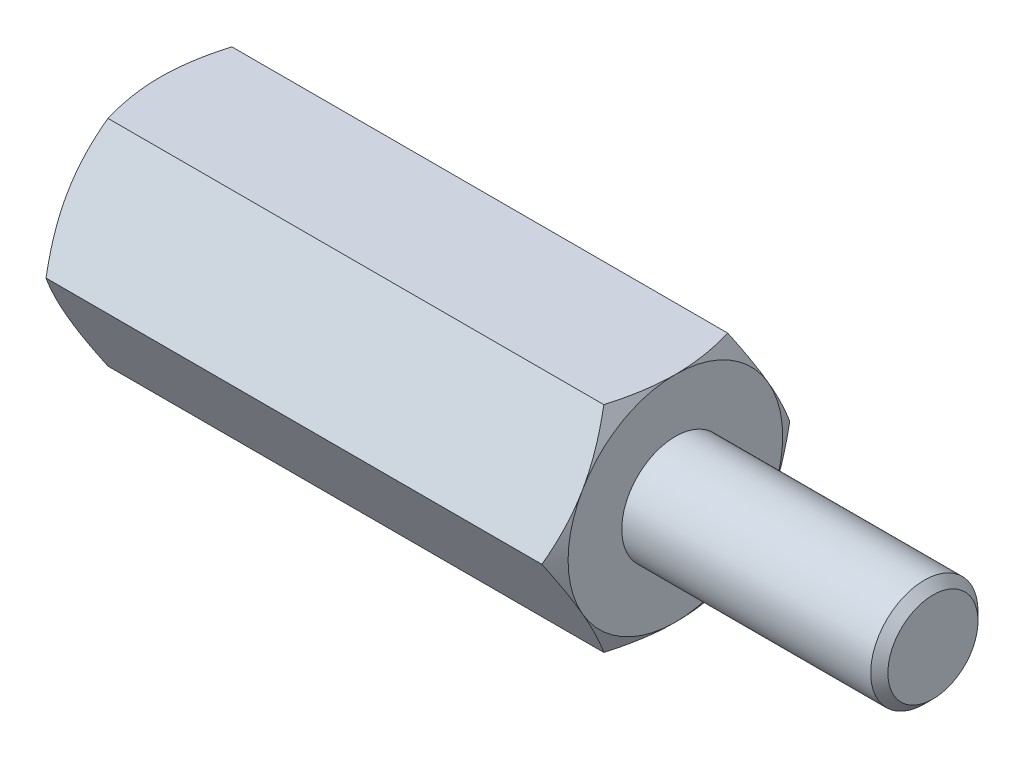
ISO-10303-21;
HEADER;
FILE_DESCRIPTION(('STEP AP214'),'2;1');
FILE_NAME('part.step','',(''),(''),'','','');
FILE_SCHEMA(('AUTOMOTIVE_DESIGN { 1 0 10303 214 1 1 1 1 }'));
ENDSEC;
DATA;
#1=APPLICATION_CONTEXT('core data for automotive mechanical design processes');
#2=APPLICATION_PROTOCOL_DEFINITION('international standard','automotive_design',2000,#1);
#3=PRODUCT_CONTEXT('',#1,'mechanical');
#4=PRODUCT('Part','Part','',(#3));
#5=PRODUCT_RELATED_PRODUCT_CATEGORY('part','',(#4));
#6=PRODUCT_DEFINITION_FORMATION('','',#4);
#7=PRODUCT_DEFINITION_CONTEXT('part definition',#1,'design');
#8=PRODUCT_DEFINITION('design','',#6,#7);
#9=PRODUCT_DEFINITION_SHAPE('','',#8);
#10=(LENGTH_UNIT() NAMED_UNIT(*) SI_UNIT(.MILLI.,.METRE.));
#11=(NAMED_UNIT(*) PLANE_ANGLE_UNIT() SI_UNIT($,.RADIAN.));
#12=(NAMED_UNIT(*) SI_UNIT($,.STERADIAN.) SOLID_ANGLE_UNIT());
#13=UNCERTAINTY_MEASURE_WITH_UNIT(LENGTH_MEASURE(1.E-05),#10,'distance_accuracy_value','');
#14=(GEOMETRIC_REPRESENTATION_CONTEXT(3) GLOBAL_UNCERTAINTY_ASSIGNED_CONTEXT((#13)) GLOBAL_UNIT_ASSIGNED_CONTEXT((#10,
#11,#12)) REPRESENTATION_CONTEXT('',''));
#15=CARTESIAN_POINT('',(0.,0.,0.));
#16=DIRECTION('',(0.,0.,1.));
#17=DIRECTION('',(1.,0.,0.));
#18=AXIS2_PLACEMENT_3D('',#15,#16,#17);
#19=CARTESIAN_POINT('',(6.,2.5,-1.44337567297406));
#20=DIRECTION('',(1.,0.,0.));
#21=DIRECTION('',(0.,0.,-1.));
#22=AXIS2_PLACEMENT_3D('',#19,#20,#21);
#23=PLANE('',#22);
#24=CARTESIAN_POINT('',(6.,0.,0.));
#25=DIRECTION('',(1.,0.,0.));
#26=DIRECTION('',(0.,0.,-1.));
#27=AXIS2_PLACEMENT_3D('',#24,#25,#26);
#28=CIRCLE('',#27,2.5);
#29=CARTESIAN_POINT('',(6.,-1.25,-2.1650635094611));
#30=VERTEX_POINT('',#29);
#31=CARTESIAN_POINT('',(6.,1.25,-2.1650635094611));
#32=VERTEX_POINT('',#31);
#33=EDGE_CURVE('E288',#30,#32,#28,.T.);
#34=ORIENTED_EDGE('',*,*,#33,.T.);
#35=CARTESIAN_POINT('',(6.,2.5,0.));
#36=VERTEX_POINT('',#35);
#37=EDGE_CURVE('E53',#32,#36,#28,.T.);
#38=ORIENTED_EDGE('',*,*,#37,.T.);
#39=CARTESIAN_POINT('',(6.,1.25,2.1650635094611));
#40=VERTEX_POINT('',#39);
#41=EDGE_CURVE('E297',#36,#40,#28,.T.);
#42=ORIENTED_EDGE('',*,*,#41,.T.);
#43=CARTESIAN_POINT('',(6.,-1.25,2.1650635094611));
#44=VERTEX_POINT('',#43);
#45=EDGE_CURVE('E301',#40,#44,#28,.T.);
#46=ORIENTED_EDGE('',*,*,#45,.T.);
#47=CARTESIAN_POINT('',(6.,0.,0.));
#48=DIRECTION('',(-1.,0.,0.));
#49=DIRECTION('',(0.,-1.,0.));
#50=AXIS2_PLACEMENT_3D('',#47,#48,#49);
#51=CIRCLE('',#50,2.5);
#52=CARTESIAN_POINT('',(6.,-2.5,0.));
#53=VERTEX_POINT('',#52);
#54=EDGE_CURVE('E193',#53,#44,#51,.T.);
#55=ORIENTED_EDGE('',*,*,#54,.F.);
#56=EDGE_CURVE('E61',#53,#30,#28,.T.);
#57=ORIENTED_EDGE('',*,*,#56,.T.);
#58=EDGE_LOOP('',(#34,#38,#42,#46,#55,#57));
#59=FACE_BOUND('',#58,.T.);
#60=CARTESIAN_POINT('',(6.,0.,0.));
#61=DIRECTION('',(1.,0.,0.));
#62=DIRECTION('',(0.,0.,-1.));
#63=AXIS2_PLACEMENT_3D('',#60,#61,#62);
#64=CIRCLE('',#63,1.25);
#65=CARTESIAN_POINT('',(6.,0.,-1.25));
#66=VERTEX_POINT('',#65);
#67=EDGE_CURVE('E322',#66,#66,#64,.T.);
#68=ORIENTED_EDGE('',*,*,#67,.F.);
#69=EDGE_LOOP('',(#68));
#70=FACE_BOUND('',#69,.T.);
#71=ADVANCED_FACE('F37',(#59,#70),#23,.T.);
#72=CARTESIAN_POINT('',(6.,0.,-2.88675134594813));
#73=DIRECTION('',(0.,-0.5,0.866025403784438));
#74=DIRECTION('',(0.,-0.866025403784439,-0.5));
#75=AXIS2_PLACEMENT_3D('',#72,#73,#74);
#76=PLANE('',#75);
#77=CARTESIAN_POINT('',(5.77664233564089,-0.000199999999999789,-2.88686681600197));
#78=CARTESIAN_POINT('',(5.81327837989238,0.109663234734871,-2.82343724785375));
#79=CARTESIAN_POINT('',(5.84659778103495,0.220474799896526,-2.75946016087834));
#80=CARTESIAN_POINT('',(5.90475771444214,0.444016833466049,-2.63039810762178));
#81=CARTESIAN_POINT('',(5.92957767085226,0.556751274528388,-2.5653108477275));
#82=CARTESIAN_POINT('',(5.96821434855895,0.780822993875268,-2.43594298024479));
#83=CARTESIAN_POINT('',(5.98228820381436,0.892125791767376,-2.37168227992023));
#84=CARTESIAN_POINT('',(5.99909084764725,1.11525522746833,-2.24285844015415));
#85=CARTESIAN_POINT('',(6.00183354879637,1.22708105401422,-2.17829576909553));
#86=CARTESIAN_POINT('',(5.99613423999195,1.43604197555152,-2.05765212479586));
#87=CARTESIAN_POINT('',(5.98909160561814,1.53320831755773,-2.0015531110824));
#88=CARTESIAN_POINT('',(5.96676858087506,1.726907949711,-1.88972057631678));
#89=CARTESIAN_POINT('',(5.95148056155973,1.82344056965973,-1.8339874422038));
#90=CARTESIAN_POINT('',(5.91326090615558,2.01753972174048,-1.7219242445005));
#91=CARTESIAN_POINT('',(5.89016722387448,2.11508168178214,-1.66560836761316));
#92=CARTESIAN_POINT('',(5.83775334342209,2.30871060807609,-1.55381665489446));
#93=CARTESIAN_POINT('',(5.80844546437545,2.40480005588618,-1.49833938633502));
#94=CARTESIAN_POINT('',(5.77664233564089,2.5002,-1.44326020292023));
#95=B_SPLINE_CURVE_WITH_KNOTS('',3,(#77,#78,#79,#80,#81,#82,#83,#84,#85,#86,#87,#88,#89,#90,#91,
#92,#93,#94),.UNSPECIFIED.,.F.,.F.,(4,2,2,2,2,2,2,2,4),(0.,0.396285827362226,0.793524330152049,
1.18093086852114,1.56786160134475,1.90479741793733,2.24204551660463,2.58677531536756,
2.93082800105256),.UNSPECIFIED.);
#96=CARTESIAN_POINT('',(5.7767090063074,0.,-2.88675134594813));
#97=VERTEX_POINT('',#96);
#98=EDGE_CURVE('E330',#97,#32,#95,.T.);
#99=ORIENTED_EDGE('',*,*,#98,.F.);
#100=DIRECTION('',(-1.,0.,0.));
#101=VECTOR('',#100,1.);
#102=CARTESIAN_POINT('',(6.,0.,-2.88675134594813));
#103=LINE('',#102,#101);
#104=CARTESIAN_POINT('',(-5.7767090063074,0.,-2.88675134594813));
#105=VERTEX_POINT('',#104);
#106=EDGE_CURVE('E264',#97,#105,#103,.T.);
#107=ORIENTED_EDGE('',*,*,#106,.T.);
#108=CARTESIAN_POINT('',(-5.77664233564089,2.5002,-1.44326020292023));
#109=CARTESIAN_POINT('',(-5.81327837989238,2.39033676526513,-1.50668977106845));
#110=CARTESIAN_POINT('',(-5.84659778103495,2.27952520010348,-1.57066685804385));
#111=CARTESIAN_POINT('',(-5.90475771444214,2.05598316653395,-1.69972891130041));
#112=CARTESIAN_POINT('',(-5.92957767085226,1.94324872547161,-1.7648161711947));
#113=CARTESIAN_POINT('',(-5.96821434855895,1.71917700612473,-1.8941840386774));
#114=CARTESIAN_POINT('',(-5.98228820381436,1.60787420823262,-1.95844473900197));
#115=CARTESIAN_POINT('',(-5.99909084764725,1.38474477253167,-2.08726857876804));
#116=CARTESIAN_POINT('',(-6.00183354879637,1.27291894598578,-2.15183124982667));
#117=CARTESIAN_POINT('',(-5.99613423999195,1.06395802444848,-2.27247489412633));
#118=CARTESIAN_POINT('',(-5.98909160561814,0.96679168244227,-2.32857390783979));
#119=CARTESIAN_POINT('',(-5.96676858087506,0.773092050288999,-2.44040644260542));
#120=CARTESIAN_POINT('',(-5.95148056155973,0.676559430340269,-2.49613957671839));
#121=CARTESIAN_POINT('',(-5.91326090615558,0.482460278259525,-2.60820277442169));
#122=CARTESIAN_POINT('',(-5.89016722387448,0.38491831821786,-2.66451865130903));
#123=CARTESIAN_POINT('',(-5.83775334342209,0.191289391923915,-2.77631036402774));
#124=CARTESIAN_POINT('',(-5.80844546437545,0.095199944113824,-2.83178763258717));
#125=CARTESIAN_POINT('',(-5.77664233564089,-0.000199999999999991,-2.88686681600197));
#126=B_SPLINE_CURVE_WITH_KNOTS('',3,(#108,#109,#110,#111,#112,#113,#114,#115,#116,#117,#118,
#119,#120,#121,#122,#123,#124,#125),.UNSPECIFIED.,.F.,.F.,(4,2,2,2,2,2,2,2,4),(0.,
0.396285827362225,0.793524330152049,1.18093086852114,1.56786160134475,1.90479741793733,
2.24204551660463,2.58677531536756,2.93082800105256),.UNSPECIFIED.);
#127=CARTESIAN_POINT('',(-6.,1.25,-2.1650635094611));
#128=VERTEX_POINT('',#127);
#129=EDGE_CURVE('E417',#128,#105,#126,.T.);
#130=ORIENTED_EDGE('',*,*,#129,.F.);
#131=CARTESIAN_POINT('',(-5.7767090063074,2.5,-1.44337567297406));
#132=VERTEX_POINT('',#131);
#133=EDGE_CURVE('E371',#132,#128,#126,.T.);
#134=ORIENTED_EDGE('',*,*,#133,.F.);
#135=DIRECTION('',(-1.,0.,0.));
#136=VECTOR('',#135,1.);
#137=CARTESIAN_POINT('',(6.,2.5,-1.44337567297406));
#138=LINE('',#137,#136);
#139=CARTESIAN_POINT('',(5.77670900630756,2.5,-1.44337567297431));
#140=VERTEX_POINT('',#139);
#141=EDGE_CURVE('E279',#140,#132,#138,.T.);
#142=ORIENTED_EDGE('',*,*,#141,.F.);
#143=EDGE_CURVE('E229',#32,#140,#95,.T.);
#144=ORIENTED_EDGE('',*,*,#143,.F.);
#145=EDGE_LOOP('',(#99,#107,#130,#134,#142,#144));
#146=FACE_BOUND('',#145,.T.);
#147=ADVANCED_FACE('F148',(#146),#76,.F.);
#148=CARTESIAN_POINT('',(6.,2.5,-1.44337567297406));
#149=DIRECTION('',(0.,-1.,0.));
#150=DIRECTION('',(0.,0.,-1.));
#151=AXIS2_PLACEMENT_3D('',#148,#149,#150);
#152=PLANE('',#151);
#153=CARTESIAN_POINT('',(4.76803388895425,2.5,-3.90158441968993));
#154=CARTESIAN_POINT('',(4.82120772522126,2.5,-3.79217004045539));
#155=CARTESIAN_POINT('',(4.87387869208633,2.5,-3.68250707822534));
#156=CARTESIAN_POINT('',(4.97793249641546,2.5,-3.46255185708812));
#157=CARTESIAN_POINT('',(5.02931513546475,2.5,-3.35225950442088));
#158=CARTESIAN_POINT('',(5.13076309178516,2.5,-3.130356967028));
#159=CARTESIAN_POINT('',(5.18081992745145,2.5,-3.01874289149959));
#160=CARTESIAN_POINT('',(5.27891712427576,2.5,-2.79463535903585));
#161=CARTESIAN_POINT('',(5.32695757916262,2.5,-2.68214194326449));
#162=CARTESIAN_POINT('',(5.42201845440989,2.5,-2.45240385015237));
#163=CARTESIAN_POINT('',(5.46895431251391,2.5,-2.33512399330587));
#164=CARTESIAN_POINT('',(5.55933269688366,2.5,-2.09920133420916));
#165=CARTESIAN_POINT('',(5.60277483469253,2.5,-1.98055838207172));
#166=CARTESIAN_POINT('',(5.68504351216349,2.5,-1.74193489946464));
#167=CARTESIAN_POINT('',(5.72387917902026,2.5,-1.6219575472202));
#168=CARTESIAN_POINT('',(5.79570507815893,2.5,-1.38028205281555));
#169=CARTESIAN_POINT('',(5.82869712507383,2.5,-1.25858445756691));
#170=CARTESIAN_POINT('',(5.88709594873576,2.5,-1.01406369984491));
#171=CARTESIAN_POINT('',(5.91254379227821,2.5,-0.891250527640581));
#172=CARTESIAN_POINT('',(5.95442751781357,2.5,-0.644071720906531));
#173=CARTESIAN_POINT('',(5.97086432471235,2.5,-0.519706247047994));
#174=CARTESIAN_POINT('',(5.9932006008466,2.5,-0.271679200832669));
#175=CARTESIAN_POINT('',(5.99923751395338,2.5,-0.148030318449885));
#176=CARTESIAN_POINT('',(6.00062561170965,2.5,0.0993395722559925));
#177=CARTESIAN_POINT('',(5.99597656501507,2.5,0.223060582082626));
#178=CARTESIAN_POINT('',(5.97940443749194,2.5,0.432351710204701));
#179=CARTESIAN_POINT('',(5.97010665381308,2.5,0.518143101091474));
#180=CARTESIAN_POINT('',(5.94693847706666,2.5,0.689112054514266));
#181=CARTESIAN_POINT('',(5.93306748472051,2.5,0.774289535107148));
#182=CARTESIAN_POINT('',(5.88532020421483,2.5,1.02876599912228));
#183=CARTESIAN_POINT('',(5.84531764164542,2.5,1.19691958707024));
#184=CARTESIAN_POINT('',(5.75226567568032,2.5,1.53362893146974));
#185=CARTESIAN_POINT('',(5.69893620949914,2.5,1.70210423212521));
#186=CARTESIAN_POINT('',(5.61237169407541,2.5,1.95247339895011));
#187=CARTESIAN_POINT('',(5.58242477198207,2.5,2.03553184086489));
#188=CARTESIAN_POINT('',(5.52068409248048,2.5,2.20095860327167));
#189=CARTESIAN_POINT('',(5.48889037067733,2.5,2.2833269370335));
#190=CARTESIAN_POINT('',(5.40401426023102,2.5,2.49723312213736));
#191=CARTESIAN_POINT('',(5.34971733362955,2.5,2.6282879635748));
#192=CARTESIAN_POINT('',(5.2381273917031,2.5,2.88912034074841));
#193=CARTESIAN_POINT('',(5.1808341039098,2.5,3.01889775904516));
#194=CARTESIAN_POINT('',(5.06393487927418,2.5,3.27745045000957));
#195=CARTESIAN_POINT('',(5.00432825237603,2.5,3.40622540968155));
#196=CARTESIAN_POINT('',(4.8833234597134,2.5,3.66293235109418));
#197=CARTESIAN_POINT('',(4.82192524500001,2.5,3.79086430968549));
#198=CARTESIAN_POINT('',(4.6354580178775,2.5,4.17399495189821));
#199=CARTESIAN_POINT('',(4.50828249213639,2.5,4.42816724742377));
#200=CARTESIAN_POINT('',(4.25034557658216,2.5,4.93461464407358));
#201=CARTESIAN_POINT('',(4.11958483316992,2.5,5.18689007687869));
#202=CARTESIAN_POINT('',(3.86871001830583,2.5,5.66512451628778));
#203=CARTESIAN_POINT('',(3.74882986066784,2.5,5.89120644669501));
#204=CARTESIAN_POINT('',(3.50759021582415,2.5,6.34259369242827));
#205=CARTESIAN_POINT('',(3.38623065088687,2.5,6.56789896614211));
#206=CARTESIAN_POINT('',(3.14278038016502,2.5,7.01722044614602));
#207=CARTESIAN_POINT('',(3.02069305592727,2.5,7.24123848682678));
#208=CARTESIAN_POINT('',(2.77566624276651,2.5,7.68878772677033));
#209=CARTESIAN_POINT('',(2.65272681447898,2.5,7.9123189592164));
#210=CARTESIAN_POINT('',(2.52947566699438,2.5,8.13567697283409));
#211=B_SPLINE_CURVE_WITH_KNOTS('',3,(#153,#154,#155,#156,#157,#158,#159,#160,#161,#162,#163,
#164,#165,#166,#167,#168,#169,#170,#171,#172,#173,#174,#175,#176,#177,#178,#179,#180,#181,#182,
#183,#184,#185,#186,#187,#188,#189,#190,#191,#192,#193,#194,#195,#196,#197,#198,#199,#200,#201,
#202,#203,#204,#205,#206,#207,#208,#209,#210),.UNSPECIFIED.,.F.,.F.,(4,2,2,2,2,2,2,2,2,2,2,2,2,
2,2,2,2,2,2,2,2,2,2,2,2,2,2,2,4),(0.,0.364957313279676,0.729970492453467,1.09692930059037,
1.46387103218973,1.84279746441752,2.22176597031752,2.59997058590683,2.97805755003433,
3.35404692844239,3.72999770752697,4.10094071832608,4.47189175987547,4.73064905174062,
4.98944026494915,5.5072907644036,6.03710483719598,6.30196454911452,6.56681915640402,
6.99233818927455,7.41789598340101,7.84358170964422,8.26927907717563,9.12186602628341,
9.97430025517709,10.7419897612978,11.5097197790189,12.2750964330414,13.0404191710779),.UNSPECIFIED.);
#212=EDGE_CURVE('E227',#140,#36,#211,.T.);
#213=ORIENTED_EDGE('',*,*,#212,.F.);
#214=ORIENTED_EDGE('',*,*,#141,.T.);
#215=CARTESIAN_POINT('',(-4.76803388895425,2.5,-3.90158441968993));
#216=CARTESIAN_POINT('',(-4.82120772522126,2.5,-3.79217004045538));
#217=CARTESIAN_POINT('',(-4.87387869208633,2.5,-3.68250707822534));
#218=CARTESIAN_POINT('',(-4.97793249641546,2.5,-3.46255185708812));
#219=CARTESIAN_POINT('',(-5.02931513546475,2.5,-3.35225950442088));
#220=CARTESIAN_POINT('',(-5.13076309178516,2.5,-3.130356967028));
#221=CARTESIAN_POINT('',(-5.18081992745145,2.5,-3.01874289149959));
#222=CARTESIAN_POINT('',(-5.27891712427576,2.5,-2.79463535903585));
#223=CARTESIAN_POINT('',(-5.32695757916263,2.5,-2.68214194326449));
#224=CARTESIAN_POINT('',(-5.42201845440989,2.5,-2.45240385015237));
#225=CARTESIAN_POINT('',(-5.46895431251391,2.5,-2.33512399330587));
#226=CARTESIAN_POINT('',(-5.55933269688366,2.5,-2.09920133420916));
#227=CARTESIAN_POINT('',(-5.60277483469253,2.5,-1.98055838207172));
#228=CARTESIAN_POINT('',(-5.68504351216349,2.5,-1.74193489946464));
#229=CARTESIAN_POINT('',(-5.72387917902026,2.5,-1.6219575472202));
#230=CARTESIAN_POINT('',(-5.79570507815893,2.5,-1.38028205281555));
#231=CARTESIAN_POINT('',(-5.82869712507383,2.5,-1.25858445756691));
#232=CARTESIAN_POINT('',(-5.88709594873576,2.5,-1.01406369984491));
#233=CARTESIAN_POINT('',(-5.91254379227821,2.5,-0.891250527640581));
#234=CARTESIAN_POINT('',(-5.95442751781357,2.5,-0.64407172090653));
#235=CARTESIAN_POINT('',(-5.97086432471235,2.5,-0.519706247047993));
#236=CARTESIAN_POINT('',(-5.9932006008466,2.5,-0.271679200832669));
#237=CARTESIAN_POINT('',(-5.99923751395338,2.5,-0.148030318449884));
#238=CARTESIAN_POINT('',(-6.00062561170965,2.5,0.0993395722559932));
#239=CARTESIAN_POINT('',(-5.99597656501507,2.5,0.223060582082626));
#240=CARTESIAN_POINT('',(-5.97940443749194,2.5,0.432351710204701));
#241=CARTESIAN_POINT('',(-5.97010665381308,2.5,0.518143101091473));
#242=CARTESIAN_POINT('',(-5.94693847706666,2.5,0.689112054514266));
#243=CARTESIAN_POINT('',(-5.93306748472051,2.5,0.774289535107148));
#244=CARTESIAN_POINT('',(-5.88532020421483,2.5,1.02876599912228));
#245=CARTESIAN_POINT('',(-5.84531764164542,2.5,1.19691958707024));
#246=CARTESIAN_POINT('',(-5.75226567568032,2.5,1.53362893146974));
#247=CARTESIAN_POINT('',(-5.69893620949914,2.5,1.70210423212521));
#248=CARTESIAN_POINT('',(-5.61237169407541,2.5,1.95247339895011));
#249=CARTESIAN_POINT('',(-5.58242477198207,2.5,2.03553184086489));
#250=CARTESIAN_POINT('',(-5.52068409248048,2.5,2.20095860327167));
#251=CARTESIAN_POINT('',(-5.48889037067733,2.5,2.2833269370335));
#252=CARTESIAN_POINT('',(-5.40401426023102,2.5,2.49723312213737));
#253=CARTESIAN_POINT('',(-5.34971733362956,2.5,2.6282879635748));
#254=CARTESIAN_POINT('',(-5.2381273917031,2.5,2.88912034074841));
#255=CARTESIAN_POINT('',(-5.1808341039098,2.5,3.01889775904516));
#256=CARTESIAN_POINT('',(-5.06393487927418,2.5,3.27745045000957));
#257=CARTESIAN_POINT('',(-5.00432825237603,2.5,3.40622540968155));
#258=CARTESIAN_POINT('',(-4.88332345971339,2.5,3.66293235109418));
#259=CARTESIAN_POINT('',(-4.82192524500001,2.5,3.79086430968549));
#260=CARTESIAN_POINT('',(-4.6354580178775,2.5,4.17399495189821));
#261=CARTESIAN_POINT('',(-4.50828249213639,2.5,4.42816724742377));
#262=CARTESIAN_POINT('',(-4.25034557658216,2.5,4.93461464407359));
#263=CARTESIAN_POINT('',(-4.11958483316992,2.5,5.18689007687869));
#264=CARTESIAN_POINT('',(-3.86871001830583,2.5,5.66512451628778));
#265=CARTESIAN_POINT('',(-3.74882986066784,2.5,5.89120644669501));
#266=CARTESIAN_POINT('',(-3.50759021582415,2.5,6.34259369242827));
#267=CARTESIAN_POINT('',(-3.38623065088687,2.5,6.56789896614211));
#268=CARTESIAN_POINT('',(-3.14278038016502,2.5,7.01722044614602));
#269=CARTESIAN_POINT('',(-3.02069305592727,2.5,7.24123848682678));
#270=CARTESIAN_POINT('',(-2.77566624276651,2.5,7.68878772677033));
#271=CARTESIAN_POINT('',(-2.65272681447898,2.5,7.9123189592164));
#272=CARTESIAN_POINT('',(-2.52947566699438,2.5,8.13567697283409));
#273=B_SPLINE_CURVE_WITH_KNOTS('',3,(#215,#216,#217,#218,#219,#220,#221,#222,#223,#224,#225,
#226,#227,#228,#229,#230,#231,#232,#233,#234,#235,#236,#237,#238,#239,#240,#241,#242,#243,#244,
#245,#246,#247,#248,#249,#250,#251,#252,#253,#254,#255,#256,#257,#258,#259,#260,#261,#262,#263,
#264,#265,#266,#267,#268,#269,#270,#271,#272),.UNSPECIFIED.,.F.,.F.,(4,2,2,2,2,2,2,2,2,2,2,2,2,
2,2,2,2,2,2,2,2,2,2,2,2,2,2,2,4),(0.,0.364957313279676,0.729970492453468,1.09692930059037,
1.46387103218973,1.84279746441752,2.22176597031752,2.59997058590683,2.97805755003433,
3.35404692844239,3.72999770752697,4.10094071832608,4.47189175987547,4.73064905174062,
4.98944026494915,5.5072907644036,6.03710483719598,6.30196454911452,6.56681915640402,
6.99233818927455,7.41789598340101,7.84358170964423,8.26927907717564,9.12186602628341,
9.9743002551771,10.7419897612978,11.5097197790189,12.2750964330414,13.0404191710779),.UNSPECIFIED.);
#274=CARTESIAN_POINT('',(-6.,2.5,0.));
#275=VERTEX_POINT('',#274);
#276=EDGE_CURVE('E241',#275,#132,#273,.F.);
#277=ORIENTED_EDGE('',*,*,#276,.F.);
#278=CARTESIAN_POINT('',(-5.7767090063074,2.5,1.44337567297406));
#279=VERTEX_POINT('',#278);
#280=EDGE_CURVE('E249',#279,#275,#273,.F.);
#281=ORIENTED_EDGE('',*,*,#280,.F.);
#282=DIRECTION('',(-1.,0.,0.));
#283=VECTOR('',#282,1.);
#284=CARTESIAN_POINT('',(6.,2.5,1.44337567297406));
#285=LINE('',#284,#283);
#286=CARTESIAN_POINT('',(5.7767090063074,2.5,1.44337567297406));
#287=VERTEX_POINT('',#286);
#288=EDGE_CURVE('E276',#287,#279,#285,.T.);
#289=ORIENTED_EDGE('',*,*,#288,.F.);
#290=EDGE_CURVE('E221',#36,#287,#211,.T.);
#291=ORIENTED_EDGE('',*,*,#290,.F.);
#292=EDGE_LOOP('',(#213,#214,#277,#281,#289,#291));
#293=FACE_BOUND('',#292,.T.);
#294=ADVANCED_FACE('F153',(#293),#152,.F.);
#295=CARTESIAN_POINT('',(6.,2.5,1.44337567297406));
#296=DIRECTION('',(0.,-0.5,-0.866025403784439));
#297=DIRECTION('',(0.,0.866025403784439,-0.5));
#298=AXIS2_PLACEMENT_3D('',#295,#296,#297);
#299=PLANE('',#298);
#300=CARTESIAN_POINT('',(5.77664233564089,2.5002,1.44326020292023));
#301=CARTESIAN_POINT('',(5.81327837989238,2.39033676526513,1.50668977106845));
#302=CARTESIAN_POINT('',(5.84659778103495,2.27952520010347,1.57066685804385));
#303=CARTESIAN_POINT('',(5.90475771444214,2.05598316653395,1.69972891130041));
#304=CARTESIAN_POINT('',(5.92957767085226,1.94324872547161,1.7648161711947));
#305=CARTESIAN_POINT('',(5.96821434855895,1.71917700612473,1.8941840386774));
#306=CARTESIAN_POINT('',(5.98228820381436,1.60787420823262,1.95844473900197));
#307=CARTESIAN_POINT('',(5.99909084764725,1.38474477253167,2.08726857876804));
#308=CARTESIAN_POINT('',(6.00183354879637,1.27291894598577,2.15183124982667));
#309=CARTESIAN_POINT('',(5.99613423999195,1.06395802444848,2.27247489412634));
#310=CARTESIAN_POINT('',(5.98909160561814,0.966791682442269,2.32857390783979));
#311=CARTESIAN_POINT('',(5.96676858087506,0.773092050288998,2.44040644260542));
#312=CARTESIAN_POINT('',(5.95148056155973,0.676559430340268,2.49613957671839));
#313=CARTESIAN_POINT('',(5.91326090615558,0.482460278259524,2.60820277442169));
#314=CARTESIAN_POINT('',(5.89016722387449,0.384918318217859,2.66451865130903));
#315=CARTESIAN_POINT('',(5.83775334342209,0.191289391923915,2.77631036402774));
#316=CARTESIAN_POINT('',(5.80844546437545,0.0951999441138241,2.83178763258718));
#317=CARTESIAN_POINT('',(5.77664233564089,-0.000199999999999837,2.88686681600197));
#318=B_SPLINE_CURVE_WITH_KNOTS('',3,(#300,#301,#302,#303,#304,#305,#306,#307,#308,#309,#310,
#311,#312,#313,#314,#315,#316,#317),.UNSPECIFIED.,.F.,.F.,(4,2,2,2,2,2,2,2,4),(0.,
0.396285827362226,0.79352433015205,1.18093086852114,1.56786160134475,1.90479741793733,
2.24204551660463,2.58677531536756,2.93082800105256),.UNSPECIFIED.);
#319=EDGE_CURVE('E228',#287,#40,#318,.T.);
#320=ORIENTED_EDGE('',*,*,#319,.F.);
#321=ORIENTED_EDGE('',*,*,#288,.T.);
#322=CARTESIAN_POINT('',(-5.77664233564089,-0.000199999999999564,2.88686681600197));
#323=CARTESIAN_POINT('',(-5.81327837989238,0.109663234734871,2.82343724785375));
#324=CARTESIAN_POINT('',(-5.84659778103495,0.220474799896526,2.75946016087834));
#325=CARTESIAN_POINT('',(-5.90475771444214,0.44401683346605,2.63039810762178));
#326=CARTESIAN_POINT('',(-5.92957767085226,0.556751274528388,2.5653108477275));
#327=CARTESIAN_POINT('',(-5.96821434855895,0.780822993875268,2.43594298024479));
#328=CARTESIAN_POINT('',(-5.98228820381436,0.892125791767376,2.37168227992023));
#329=CARTESIAN_POINT('',(-5.99909084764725,1.11525522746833,2.24285844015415));
#330=CARTESIAN_POINT('',(-6.00183354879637,1.22708105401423,2.17829576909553));
#331=CARTESIAN_POINT('',(-5.99613423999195,1.43604197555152,2.05765212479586));
#332=CARTESIAN_POINT('',(-5.98909160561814,1.53320831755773,2.0015531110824));
#333=CARTESIAN_POINT('',(-5.96676858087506,1.726907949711,1.88972057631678));
#334=CARTESIAN_POINT('',(-5.95148056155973,1.82344056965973,1.8339874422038));
#335=CARTESIAN_POINT('',(-5.91326090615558,2.01753972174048,1.7219242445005));
#336=CARTESIAN_POINT('',(-5.89016722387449,2.11508168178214,1.66560836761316));
#337=CARTESIAN_POINT('',(-5.83775334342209,2.30871060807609,1.55381665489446));
#338=CARTESIAN_POINT('',(-5.80844546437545,2.40480005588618,1.49833938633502));
#339=CARTESIAN_POINT('',(-5.77664233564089,2.5002,1.44326020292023));
#340=B_SPLINE_CURVE_WITH_KNOTS('',3,(#322,#323,#324,#325,#326,#327,#328,#329,#330,#331,#332,
#333,#334,#335,#336,#337,#338,#339),.UNSPECIFIED.,.F.,.F.,(4,2,2,2,2,2,2,2,4),(0.,
0.396285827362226,0.79352433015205,1.18093086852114,1.56786160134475,1.90479741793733,
2.24204551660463,2.58677531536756,2.93082800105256),.UNSPECIFIED.);
#341=CARTESIAN_POINT('',(-6.,1.25,2.1650635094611));
#342=VERTEX_POINT('',#341);
#343=EDGE_CURVE('E255',#342,#279,#340,.T.);
#344=ORIENTED_EDGE('',*,*,#343,.F.);
#345=CARTESIAN_POINT('',(-5.7767090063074,0.,2.88675134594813));
#346=VERTEX_POINT('',#345);
#347=EDGE_CURVE('E262',#346,#342,#340,.T.);
#348=ORIENTED_EDGE('',*,*,#347,.F.);
#349=DIRECTION('',(-1.,0.,0.));
#350=VECTOR('',#349,1.);
#351=CARTESIAN_POINT('',(6.,0.,2.88675134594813));
#352=LINE('',#351,#350);
#353=CARTESIAN_POINT('',(5.7767090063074,0.,2.88675134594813));
#354=VERTEX_POINT('',#353);
#355=EDGE_CURVE('E273',#354,#346,#352,.T.);
#356=ORIENTED_EDGE('',*,*,#355,.F.);
#357=EDGE_CURVE('E215',#40,#354,#318,.T.);
#358=ORIENTED_EDGE('',*,*,#357,.F.);
#359=EDGE_LOOP('',(#320,#321,#344,#348,#356,#358));
#360=FACE_BOUND('',#359,.T.);
#361=ADVANCED_FACE('F235',(#360),#299,.F.);
#362=CARTESIAN_POINT('',(6.,0.,2.88675134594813));
#363=DIRECTION('',(0.,0.5,-0.866025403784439));
#364=DIRECTION('',(0.,0.866025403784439,0.5));
#365=AXIS2_PLACEMENT_3D('',#362,#363,#364);
#366=PLANE('',#365);
#367=CARTESIAN_POINT('',(5.77664233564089,0.000200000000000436,2.88686681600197));
#368=CARTESIAN_POINT('',(5.81327837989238,-0.109663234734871,2.82343724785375));
#369=CARTESIAN_POINT('',(5.84659778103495,-0.220474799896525,2.75946016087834));
#370=CARTESIAN_POINT('',(5.90475771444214,-0.444016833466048,2.63039810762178));
#371=CARTESIAN_POINT('',(5.92957767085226,-0.556751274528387,2.5653108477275));
#372=CARTESIAN_POINT('',(5.96821434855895,-0.780822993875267,2.43594298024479));
#373=CARTESIAN_POINT('',(5.98228820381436,-0.892125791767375,2.37168227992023));
#374=CARTESIAN_POINT('',(5.99909084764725,-1.11525522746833,2.24285844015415));
#375=CARTESIAN_POINT('',(6.00183354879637,-1.22708105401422,2.17829576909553));
#376=CARTESIAN_POINT('',(5.99613423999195,-1.43604197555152,2.05765212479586));
#377=CARTESIAN_POINT('',(5.98909160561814,-1.53320831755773,2.0015531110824));
#378=CARTESIAN_POINT('',(5.96676858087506,-1.726907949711,1.88972057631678));
#379=CARTESIAN_POINT('',(5.95148056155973,-1.82344056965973,1.8339874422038));
#380=CARTESIAN_POINT('',(5.91326090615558,-2.01753972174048,1.7219242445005));
#381=CARTESIAN_POINT('',(5.89016722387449,-2.11508168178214,1.66560836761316));
#382=CARTESIAN_POINT('',(5.83775334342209,-2.30871060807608,1.55381665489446));
#383=CARTESIAN_POINT('',(5.80844546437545,-2.40480005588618,1.49833938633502));
#384=CARTESIAN_POINT('',(5.77664233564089,-2.5002,1.44326020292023));
#385=B_SPLINE_CURVE_WITH_KNOTS('',3,(#367,#368,#369,#370,#371,#372,#373,#374,#375,#376,#377,
#378,#379,#380,#381,#382,#383,#384),.UNSPECIFIED.,.F.,.F.,(4,2,2,2,2,2,2,2,4),(0.,
0.396285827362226,0.793524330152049,1.18093086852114,1.56786160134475,1.90479741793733,
2.24204551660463,2.58677531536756,2.93082800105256),.UNSPECIFIED.);
#386=EDGE_CURVE('E347',#354,#44,#385,.T.);
#387=ORIENTED_EDGE('',*,*,#386,.F.);
#388=ORIENTED_EDGE('',*,*,#355,.T.);
#389=CARTESIAN_POINT('',(-5.77664233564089,-2.5002,1.44326020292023));
#390=CARTESIAN_POINT('',(-5.81327837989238,-2.39033676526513,1.50668977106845));
#391=CARTESIAN_POINT('',(-5.84659778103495,-2.27952520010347,1.57066685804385));
#392=CARTESIAN_POINT('',(-5.90475771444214,-2.05598316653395,1.69972891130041));
#393=CARTESIAN_POINT('',(-5.92957767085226,-1.94324872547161,1.7648161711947));
#394=CARTESIAN_POINT('',(-5.96821434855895,-1.71917700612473,1.8941840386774));
#395=CARTESIAN_POINT('',(-5.98228820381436,-1.60787420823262,1.95844473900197));
#396=CARTESIAN_POINT('',(-5.99909084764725,-1.38474477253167,2.08726857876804));
#397=CARTESIAN_POINT('',(-6.00183354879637,-1.27291894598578,2.15183124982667));
#398=CARTESIAN_POINT('',(-5.99613423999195,-1.06395802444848,2.27247489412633));
#399=CARTESIAN_POINT('',(-5.98909160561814,-0.96679168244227,2.32857390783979));
#400=CARTESIAN_POINT('',(-5.96676858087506,-0.773092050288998,2.44040644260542));
#401=CARTESIAN_POINT('',(-5.95148056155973,-0.676559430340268,2.49613957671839));
#402=CARTESIAN_POINT('',(-5.91326090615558,-0.482460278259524,2.60820277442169));
#403=CARTESIAN_POINT('',(-5.89016722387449,-0.384918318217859,2.66451865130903));
#404=CARTESIAN_POINT('',(-5.83775334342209,-0.191289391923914,2.77631036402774));
#405=CARTESIAN_POINT('',(-5.80844546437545,-0.0951999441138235,2.83178763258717));
#406=CARTESIAN_POINT('',(-5.77664233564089,0.000200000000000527,2.88686681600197));
#407=B_SPLINE_CURVE_WITH_KNOTS('',3,(#389,#390,#391,#392,#393,#394,#395,#396,#397,#398,#399,
#400,#401,#402,#403,#404,#405,#406),.UNSPECIFIED.,.F.,.F.,(4,2,2,2,2,2,2,2,4),(0.,
0.396285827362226,0.793524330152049,1.18093086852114,1.56786160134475,1.90479741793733,
2.24204551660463,2.58677531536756,2.93082800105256),.UNSPECIFIED.);
#408=CARTESIAN_POINT('',(-6.,-1.25,2.1650635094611));
#409=VERTEX_POINT('',#408);
#410=EDGE_CURVE('E263',#409,#346,#407,.T.);
#411=ORIENTED_EDGE('',*,*,#410,.F.);
#412=CARTESIAN_POINT('',(-5.7767090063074,-2.5,1.44337567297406));
#413=VERTEX_POINT('',#412);
#414=EDGE_CURVE('E250',#413,#409,#407,.T.);
#415=ORIENTED_EDGE('',*,*,#414,.F.);
#416=DIRECTION('',(-1.,0.,0.));
#417=VECTOR('',#416,1.);
#418=CARTESIAN_POINT('',(6.,-2.5,1.44337567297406));
#419=LINE('',#418,#417);
#420=CARTESIAN_POINT('',(5.7767090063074,-2.5,1.44337567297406));
#421=VERTEX_POINT('',#420);
#422=EDGE_CURVE('E270',#421,#413,#419,.T.);
#423=ORIENTED_EDGE('',*,*,#422,.F.);
#424=EDGE_CURVE('E210',#44,#421,#385,.T.);
#425=ORIENTED_EDGE('',*,*,#424,.F.);
#426=EDGE_LOOP('',(#387,#388,#411,#415,#423,#425));
#427=FACE_BOUND('',#426,.T.);
#428=ADVANCED_FACE('F409',(#427),#366,.F.);
#429=CARTESIAN_POINT('',(6.,-2.5,1.44337567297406));
#430=DIRECTION('',(0.,1.,0.));
#431=DIRECTION('',(0.,0.,1.));
#432=AXIS2_PLACEMENT_3D('',#429,#430,#431);
#433=PLANE('',#432);
#434=CARTESIAN_POINT('',(4.76803388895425,-2.5,-3.90158441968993));
#435=CARTESIAN_POINT('',(4.82120772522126,-2.5,-3.79217004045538));
#436=CARTESIAN_POINT('',(4.87387869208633,-2.5,-3.68250707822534));
#437=CARTESIAN_POINT('',(4.97793249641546,-2.5,-3.46255185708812));
#438=CARTESIAN_POINT('',(5.02931513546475,-2.5,-3.35225950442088));
#439=CARTESIAN_POINT('',(5.13076309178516,-2.5,-3.130356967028));
#440=CARTESIAN_POINT('',(5.18081992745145,-2.5,-3.01874289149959));
#441=CARTESIAN_POINT('',(5.27891712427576,-2.5,-2.79463535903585));
#442=CARTESIAN_POINT('',(5.32695757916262,-2.5,-2.68214194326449));
#443=CARTESIAN_POINT('',(5.42201845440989,-2.5,-2.45240385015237));
#444=CARTESIAN_POINT('',(5.46895431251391,-2.5,-2.33512399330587));
#445=CARTESIAN_POINT('',(5.55933269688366,-2.5,-2.09920133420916));
#446=CARTESIAN_POINT('',(5.60277483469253,-2.5,-1.98055838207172));
#447=CARTESIAN_POINT('',(5.68504351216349,-2.5,-1.74193489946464));
#448=CARTESIAN_POINT('',(5.72387917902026,-2.5,-1.6219575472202));
#449=CARTESIAN_POINT('',(5.79570507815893,-2.5,-1.38028205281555));
#450=CARTESIAN_POINT('',(5.82869712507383,-2.5,-1.25858445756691));
#451=CARTESIAN_POINT('',(5.88709594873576,-2.5,-1.01406369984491));
#452=CARTESIAN_POINT('',(5.91254379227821,-2.5,-0.891250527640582));
#453=CARTESIAN_POINT('',(5.95442751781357,-2.5,-0.644071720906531));
#454=CARTESIAN_POINT('',(5.97086432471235,-2.5,-0.519706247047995));
#455=CARTESIAN_POINT('',(5.9932006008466,-2.5,-0.27167920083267));
#456=CARTESIAN_POINT('',(5.99923751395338,-2.5,-0.148030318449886));
#457=CARTESIAN_POINT('',(6.00062561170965,-2.5,0.0993395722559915));
#458=CARTESIAN_POINT('',(5.99597656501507,-2.5,0.223060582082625));
#459=CARTESIAN_POINT('',(5.97940443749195,-2.5,0.432351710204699));
#460=CARTESIAN_POINT('',(5.97010665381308,-2.5,0.518143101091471));
#461=CARTESIAN_POINT('',(5.94693847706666,-2.5,0.689112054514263));
#462=CARTESIAN_POINT('',(5.93306748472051,-2.5,0.774289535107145));
#463=CARTESIAN_POINT('',(5.88532020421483,-2.5,1.02876599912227));
#464=CARTESIAN_POINT('',(5.84531764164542,-2.5,1.19691958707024));
#465=CARTESIAN_POINT('',(5.75226567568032,-2.5,1.53362893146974));
#466=CARTESIAN_POINT('',(5.69893620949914,-2.5,1.70210423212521));
#467=CARTESIAN_POINT('',(5.61237169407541,-2.5,1.95247339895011));
#468=CARTESIAN_POINT('',(5.58242477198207,-2.5,2.03553184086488));
#469=CARTESIAN_POINT('',(5.52068409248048,-2.5,2.20095860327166));
#470=CARTESIAN_POINT('',(5.48889037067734,-2.5,2.28332693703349));
#471=CARTESIAN_POINT('',(5.40401426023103,-2.5,2.49723312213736));
#472=CARTESIAN_POINT('',(5.34971733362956,-2.5,2.6282879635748));
#473=CARTESIAN_POINT('',(5.2381273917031,-2.5,2.8891203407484));
#474=CARTESIAN_POINT('',(5.1808341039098,-2.5,3.01889775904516));
#475=CARTESIAN_POINT('',(5.06393487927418,-2.5,3.27745045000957));
#476=CARTESIAN_POINT('',(5.00432825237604,-2.5,3.40622540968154));
#477=CARTESIAN_POINT('',(4.8833234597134,-2.5,3.66293235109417));
#478=CARTESIAN_POINT('',(4.82192524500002,-2.5,3.79086430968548));
#479=CARTESIAN_POINT('',(4.6354580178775,-2.5,4.1739949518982));
#480=CARTESIAN_POINT('',(4.50828249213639,-2.5,4.42816724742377));
#481=CARTESIAN_POINT('',(4.25034557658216,-2.5,4.93461464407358));
#482=CARTESIAN_POINT('',(4.11958483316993,-2.5,5.18689007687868));
#483=CARTESIAN_POINT('',(3.86871001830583,-2.5,5.66512451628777));
#484=CARTESIAN_POINT('',(3.74882986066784,-2.5,5.891206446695));
#485=CARTESIAN_POINT('',(3.50759021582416,-2.5,6.34259369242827));
#486=CARTESIAN_POINT('',(3.38623065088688,-2.5,6.5678989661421));
#487=CARTESIAN_POINT('',(3.14278038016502,-2.5,7.01722044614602));
#488=CARTESIAN_POINT('',(3.02069305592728,-2.5,7.24123848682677));
#489=CARTESIAN_POINT('',(2.77566624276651,-2.5,7.68878772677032));
#490=CARTESIAN_POINT('',(2.65272681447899,-2.5,7.9123189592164));
#491=CARTESIAN_POINT('',(2.52947566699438,-2.5,8.13567697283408));
#492=B_SPLINE_CURVE_WITH_KNOTS('',3,(#434,#435,#436,#437,#438,#439,#440,#441,#442,#443,#444,
#445,#446,#447,#448,#449,#450,#451,#452,#453,#454,#455,#456,#457,#458,#459,#460,#461,#462,#463,
#464,#465,#466,#467,#468,#469,#470,#471,#472,#473,#474,#475,#476,#477,#478,#479,#480,#481,#482,
#483,#484,#485,#486,#487,#488,#489,#490,#491),.UNSPECIFIED.,.F.,.F.,(4,2,2,2,2,2,2,2,2,2,2,2,2,
2,2,2,2,2,2,2,2,2,2,2,2,2,2,2,4),(0.,0.364957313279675,0.729970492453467,1.09692930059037,
1.46387103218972,1.84279746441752,2.22176597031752,2.59997058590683,2.97805755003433,
3.35404692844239,3.72999770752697,4.10094071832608,4.47189175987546,4.73064905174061,
4.98944026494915,5.50729076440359,6.03710483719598,6.30196454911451,6.56681915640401,
6.99233818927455,7.417895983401,7.84358170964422,8.26927907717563,9.12186602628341,
9.97430025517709,10.7419897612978,11.5097197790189,12.2750964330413,13.0404191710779),.UNSPECIFIED.);
#493=EDGE_CURVE('E352',#421,#53,#492,.F.);
#494=ORIENTED_EDGE('',*,*,#493,.F.);
#495=ORIENTED_EDGE('',*,*,#422,.T.);
#496=CARTESIAN_POINT('',(-4.76803388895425,-2.5,-3.90158441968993));
#497=CARTESIAN_POINT('',(-4.82120772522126,-2.5,-3.79217004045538));
#498=CARTESIAN_POINT('',(-4.87387869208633,-2.5,-3.68250707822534));
#499=CARTESIAN_POINT('',(-4.97793249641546,-2.5,-3.46255185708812));
#500=CARTESIAN_POINT('',(-5.02931513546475,-2.5,-3.35225950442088));
#501=CARTESIAN_POINT('',(-5.13076309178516,-2.5,-3.130356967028));
#502=CARTESIAN_POINT('',(-5.18081992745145,-2.5,-3.01874289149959));
#503=CARTESIAN_POINT('',(-5.27891712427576,-2.5,-2.79463535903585));
#504=CARTESIAN_POINT('',(-5.32695757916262,-2.5,-2.68214194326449));
#505=CARTESIAN_POINT('',(-5.42201845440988,-2.5,-2.45240385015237));
#506=CARTESIAN_POINT('',(-5.46895431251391,-2.5,-2.33512399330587));
#507=CARTESIAN_POINT('',(-5.55933269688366,-2.5,-2.09920133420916));
#508=CARTESIAN_POINT('',(-5.60277483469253,-2.5,-1.98055838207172));
#509=CARTESIAN_POINT('',(-5.68504351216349,-2.5,-1.74193489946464));
#510=CARTESIAN_POINT('',(-5.72387917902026,-2.5,-1.6219575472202));
#511=CARTESIAN_POINT('',(-5.79570507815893,-2.5,-1.38028205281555));
#512=CARTESIAN_POINT('',(-5.82869712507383,-2.5,-1.25858445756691));
#513=CARTESIAN_POINT('',(-5.88709594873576,-2.5,-1.01406369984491));
#514=CARTESIAN_POINT('',(-5.91254379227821,-2.5,-0.891250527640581));
#515=CARTESIAN_POINT('',(-5.95442751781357,-2.5,-0.644071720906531));
#516=CARTESIAN_POINT('',(-5.97086432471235,-2.5,-0.519706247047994));
#517=CARTESIAN_POINT('',(-5.9932006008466,-2.5,-0.271679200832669));
#518=CARTESIAN_POINT('',(-5.99923751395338,-2.5,-0.148030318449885));
#519=CARTESIAN_POINT('',(-6.00062561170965,-2.5,0.0993395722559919));
#520=CARTESIAN_POINT('',(-5.99597656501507,-2.5,0.223060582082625));
#521=CARTESIAN_POINT('',(-5.97940443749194,-2.5,0.4323517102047));
#522=CARTESIAN_POINT('',(-5.97010665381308,-2.5,0.518143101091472));
#523=CARTESIAN_POINT('',(-5.94693847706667,-2.5,0.689112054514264));
#524=CARTESIAN_POINT('',(-5.93306748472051,-2.5,0.774289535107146));
#525=CARTESIAN_POINT('',(-5.88532020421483,-2.5,1.02876599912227));
#526=CARTESIAN_POINT('',(-5.84531764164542,-2.5,1.19691958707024));
#527=CARTESIAN_POINT('',(-5.75226567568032,-2.5,1.53362893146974));
#528=CARTESIAN_POINT('',(-5.69893620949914,-2.5,1.70210423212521));
#529=CARTESIAN_POINT('',(-5.61237169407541,-2.5,1.95247339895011));
#530=CARTESIAN_POINT('',(-5.58242477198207,-2.5,2.03553184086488));
#531=CARTESIAN_POINT('',(-5.52068409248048,-2.5,2.20095860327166));
#532=CARTESIAN_POINT('',(-5.48889037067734,-2.5,2.28332693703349));
#533=CARTESIAN_POINT('',(-5.40401426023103,-2.5,2.49723312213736));
#534=CARTESIAN_POINT('',(-5.34971733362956,-2.5,2.62828796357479));
#535=CARTESIAN_POINT('',(-5.2381273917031,-2.5,2.8891203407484));
#536=CARTESIAN_POINT('',(-5.1808341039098,-2.5,3.01889775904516));
#537=CARTESIAN_POINT('',(-5.06393487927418,-2.5,3.27745045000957));
#538=CARTESIAN_POINT('',(-5.00432825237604,-2.5,3.40622540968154));
#539=CARTESIAN_POINT('',(-4.8833234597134,-2.5,3.66293235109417));
#540=CARTESIAN_POINT('',(-4.82192524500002,-2.5,3.79086430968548));
#541=CARTESIAN_POINT('',(-4.6354580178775,-2.5,4.1739949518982));
#542=CARTESIAN_POINT('',(-4.50828249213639,-2.5,4.42816724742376));
#543=CARTESIAN_POINT('',(-4.25034557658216,-2.5,4.93461464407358));
#544=CARTESIAN_POINT('',(-4.11958483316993,-2.5,5.18689007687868));
#545=CARTESIAN_POINT('',(-3.86871001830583,-2.5,5.66512451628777));
#546=CARTESIAN_POINT('',(-3.74882986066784,-2.5,5.891206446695));
#547=CARTESIAN_POINT('',(-3.50759021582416,-2.5,6.34259369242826));
#548=CARTESIAN_POINT('',(-3.38623065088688,-2.5,6.5678989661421));
#549=CARTESIAN_POINT('',(-3.14278038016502,-2.5,7.01722044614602));
#550=CARTESIAN_POINT('',(-3.02069305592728,-2.5,7.24123848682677));
#551=CARTESIAN_POINT('',(-2.77566624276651,-2.5,7.68878772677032));
#552=CARTESIAN_POINT('',(-2.65272681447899,-2.5,7.9123189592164));
#553=CARTESIAN_POINT('',(-2.52947566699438,-2.5,8.13567697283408));
#554=B_SPLINE_CURVE_WITH_KNOTS('',3,(#496,#497,#498,#499,#500,#501,#502,#503,#504,#505,#506,
#507,#508,#509,#510,#511,#512,#513,#514,#515,#516,#517,#518,#519,#520,#521,#522,#523,#524,#525,
#526,#527,#528,#529,#530,#531,#532,#533,#534,#535,#536,#537,#538,#539,#540,#541,#542,#543,#544,
#545,#546,#547,#548,#549,#550,#551,#552,#553),.UNSPECIFIED.,.F.,.F.,(4,2,2,2,2,2,2,2,2,2,2,2,2,
2,2,2,2,2,2,2,2,2,2,2,2,2,2,2,4),(0.,0.364957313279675,0.729970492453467,1.09692930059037,
1.46387103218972,1.84279746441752,2.22176597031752,2.59997058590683,2.97805755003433,
3.35404692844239,3.72999770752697,4.10094071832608,4.47189175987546,4.73064905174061,
4.98944026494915,5.50729076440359,6.03710483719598,6.30196454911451,6.56681915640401,
6.99233818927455,7.417895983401,7.84358170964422,8.26927907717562,9.1218660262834,
9.97430025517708,10.7419897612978,11.5097197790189,12.2750964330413,13.0404191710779),.UNSPECIFIED.);
#555=CARTESIAN_POINT('',(-6.,-2.5,0.));
#556=VERTEX_POINT('',#555);
#557=EDGE_CURVE('E415',#556,#413,#554,.T.);
#558=ORIENTED_EDGE('',*,*,#557,.F.);
#559=CARTESIAN_POINT('',(-5.7767090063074,-2.5,-1.44337567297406));
#560=VERTEX_POINT('',#559);
#561=EDGE_CURVE('E400',#560,#556,#554,.T.);
#562=ORIENTED_EDGE('',*,*,#561,.F.);
#563=DIRECTION('',(-1.,0.,0.));
#564=VECTOR('',#563,1.);
#565=CARTESIAN_POINT('',(6.,-2.5,-1.44337567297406));
#566=LINE('',#565,#564);
#567=CARTESIAN_POINT('',(5.7767090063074,-2.5,-1.44337567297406));
#568=VERTEX_POINT('',#567);
#569=EDGE_CURVE('E267',#568,#560,#566,.T.);
#570=ORIENTED_EDGE('',*,*,#569,.F.);
#571=EDGE_CURVE('E195',#53,#568,#492,.F.);
#572=ORIENTED_EDGE('',*,*,#571,.F.);
#573=EDGE_LOOP('',(#494,#495,#558,#562,#570,#572));
#574=FACE_BOUND('',#573,.T.);
#575=ADVANCED_FACE('F172',(#574),#433,.F.);
#576=CARTESIAN_POINT('',(6.,-2.5,-1.44337567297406));
#577=DIRECTION('',(0.,0.5,0.866025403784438));
#578=DIRECTION('',(0.,-0.866025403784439,0.5));
#579=AXIS2_PLACEMENT_3D('',#576,#577,#578);
#580=PLANE('',#579);
#581=CARTESIAN_POINT('',(5.77664233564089,-2.5002,-1.44326020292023));
#582=CARTESIAN_POINT('',(5.81327837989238,-2.39033676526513,-1.50668977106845));
#583=CARTESIAN_POINT('',(5.84659778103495,-2.27952520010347,-1.57066685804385));
#584=CARTESIAN_POINT('',(5.90475771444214,-2.05598316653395,-1.69972891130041));
#585=CARTESIAN_POINT('',(5.92957767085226,-1.94324872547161,-1.7648161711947));
#586=CARTESIAN_POINT('',(5.96821434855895,-1.71917700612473,-1.8941840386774));
#587=CARTESIAN_POINT('',(5.98228820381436,-1.60787420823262,-1.95844473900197));
#588=CARTESIAN_POINT('',(5.99909084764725,-1.38474477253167,-2.08726857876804));
#589=CARTESIAN_POINT('',(6.00183354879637,-1.27291894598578,-2.15183124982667));
#590=CARTESIAN_POINT('',(5.99613423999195,-1.06395802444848,-2.27247489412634));
#591=CARTESIAN_POINT('',(5.98909160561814,-0.96679168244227,-2.32857390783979));
#592=CARTESIAN_POINT('',(5.96676858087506,-0.773092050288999,-2.44040644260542));
#593=CARTESIAN_POINT('',(5.95148056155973,-0.676559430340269,-2.49613957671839));
#594=CARTESIAN_POINT('',(5.91326090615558,-0.482460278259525,-2.60820277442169));
#595=CARTESIAN_POINT('',(5.89016722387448,-0.38491831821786,-2.66451865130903));
#596=CARTESIAN_POINT('',(5.83775334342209,-0.191289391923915,-2.77631036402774));
#597=CARTESIAN_POINT('',(5.80844546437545,-0.0951999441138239,-2.83178763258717));
#598=CARTESIAN_POINT('',(5.77664233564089,0.000200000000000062,-2.88686681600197));
#599=B_SPLINE_CURVE_WITH_KNOTS('',3,(#581,#582,#583,#584,#585,#586,#587,#588,#589,#590,#591,
#592,#593,#594,#595,#596,#597,#598),.UNSPECIFIED.,.F.,.F.,(4,2,2,2,2,2,2,2,4),(0.,
0.396285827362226,0.79352433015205,1.18093086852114,1.56786160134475,1.90479741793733,
2.24204551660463,2.58677531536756,2.93082800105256),.UNSPECIFIED.);
#600=EDGE_CURVE('E192',#568,#30,#599,.T.);
#601=ORIENTED_EDGE('',*,*,#600,.F.);
#602=ORIENTED_EDGE('',*,*,#569,.T.);
#603=CARTESIAN_POINT('',(-5.77664233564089,0.000200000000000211,-2.88686681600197));
#604=CARTESIAN_POINT('',(-5.81327837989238,-0.109663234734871,-2.82343724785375));
#605=CARTESIAN_POINT('',(-5.84659778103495,-0.220474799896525,-2.75946016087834));
#606=CARTESIAN_POINT('',(-5.90475771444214,-0.444016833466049,-2.63039810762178));
#607=CARTESIAN_POINT('',(-5.92957767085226,-0.556751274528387,-2.5653108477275));
#608=CARTESIAN_POINT('',(-5.96821434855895,-0.780822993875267,-2.43594298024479));
#609=CARTESIAN_POINT('',(-5.98228820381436,-0.892125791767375,-2.37168227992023));
#610=CARTESIAN_POINT('',(-5.99909084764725,-1.11525522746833,-2.24285844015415));
#611=CARTESIAN_POINT('',(-6.00183354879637,-1.22708105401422,-2.17829576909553));
#612=CARTESIAN_POINT('',(-5.99613423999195,-1.43604197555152,-2.05765212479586));
#613=CARTESIAN_POINT('',(-5.98909160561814,-1.53320831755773,-2.0015531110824));
#614=CARTESIAN_POINT('',(-5.96676858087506,-1.726907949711,-1.88972057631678));
#615=CARTESIAN_POINT('',(-5.95148056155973,-1.82344056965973,-1.8339874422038));
#616=CARTESIAN_POINT('',(-5.91326090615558,-2.01753972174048,-1.7219242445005));
#617=CARTESIAN_POINT('',(-5.89016722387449,-2.11508168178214,-1.66560836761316));
#618=CARTESIAN_POINT('',(-5.83775334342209,-2.30871060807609,-1.55381665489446));
#619=CARTESIAN_POINT('',(-5.80844546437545,-2.40480005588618,-1.49833938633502));
#620=CARTESIAN_POINT('',(-5.77664233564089,-2.5002,-1.44326020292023));
#621=B_SPLINE_CURVE_WITH_KNOTS('',3,(#603,#604,#605,#606,#607,#608,#609,#610,#611,#612,#613,
#614,#615,#616,#617,#618,#619,#620),.UNSPECIFIED.,.F.,.F.,(4,2,2,2,2,2,2,2,4),(0.,
0.396285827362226,0.793524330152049,1.18093086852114,1.56786160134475,1.90479741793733,
2.24204551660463,2.58677531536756,2.93082800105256),.UNSPECIFIED.);
#622=CARTESIAN_POINT('',(-6.,-1.25,-2.1650635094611));
#623=VERTEX_POINT('',#622);
#624=EDGE_CURVE('E178',#623,#560,#621,.T.);
#625=ORIENTED_EDGE('',*,*,#624,.F.);
#626=EDGE_CURVE('E404',#105,#623,#621,.T.);
#627=ORIENTED_EDGE('',*,*,#626,.F.);
#628=ORIENTED_EDGE('',*,*,#106,.F.);
#629=EDGE_CURVE('E185',#30,#97,#599,.T.);
#630=ORIENTED_EDGE('',*,*,#629,.F.);
#631=EDGE_LOOP('',(#601,#602,#625,#627,#628,#630));
#632=FACE_BOUND('',#631,.T.);
#633=ADVANCED_FACE('F167',(#632),#580,.F.);
#634=CARTESIAN_POINT('',(-6.,0.,0.));
#635=DIRECTION('',(1.,0.,0.));
#636=DIRECTION('',(0.,1.,0.));
#637=AXIS2_PLACEMENT_3D('',#634,#635,#636);
#638=CONICAL_SURFACE('',#637,2.5,1.0471975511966);
#639=ORIENTED_EDGE('',*,*,#129,.T.);
#640=ORIENTED_EDGE('',*,*,#626,.T.);
#641=CARTESIAN_POINT('',(-6.,0.,0.));
#642=DIRECTION('',(1.,0.,0.));
#643=DIRECTION('',(0.,0.,-1.));
#644=AXIS2_PLACEMENT_3D('',#641,#642,#643);
#645=CIRCLE('',#644,2.5);
#646=EDGE_CURVE('E282',#623,#128,#645,.T.);
#647=ORIENTED_EDGE('',*,*,#646,.T.);
#648=EDGE_LOOP('',(#639,#640,#647));
#649=FACE_BOUND('',#648,.T.);
#650=ADVANCED_FACE('F171',(#649),#638,.T.);
#651=ORIENTED_EDGE('',*,*,#561,.T.);
#652=EDGE_CURVE('E286',#556,#623,#645,.T.);
#653=ORIENTED_EDGE('',*,*,#652,.T.);
#654=ORIENTED_EDGE('',*,*,#624,.T.);
#655=EDGE_LOOP('',(#651,#653,#654));
#656=FACE_BOUND('',#655,.T.);
#657=ADVANCED_FACE('F398',(#656),#638,.T.);
#658=ORIENTED_EDGE('',*,*,#414,.T.);
#659=CARTESIAN_POINT('',(-6.,0.,0.));
#660=DIRECTION('',(-1.,0.,0.));
#661=DIRECTION('',(0.,-1.,0.));
#662=AXIS2_PLACEMENT_3D('',#659,#660,#661);
#663=CIRCLE('',#662,2.5);
#664=EDGE_CURVE('E334',#556,#409,#663,.T.);
#665=ORIENTED_EDGE('',*,*,#664,.F.);
#666=ORIENTED_EDGE('',*,*,#557,.T.);
#667=EDGE_LOOP('',(#658,#665,#666));
#668=FACE_BOUND('',#667,.T.);
#669=ADVANCED_FACE('F426',(#668),#638,.T.);
#670=ORIENTED_EDGE('',*,*,#347,.T.);
#671=EDGE_CURVE('E385',#342,#409,#645,.T.);
#672=ORIENTED_EDGE('',*,*,#671,.T.);
#673=ORIENTED_EDGE('',*,*,#410,.T.);
#674=EDGE_LOOP('',(#670,#672,#673));
#675=FACE_BOUND('',#674,.T.);
#676=ADVANCED_FACE('F158',(#675),#638,.T.);
#677=ORIENTED_EDGE('',*,*,#343,.T.);
#678=ORIENTED_EDGE('',*,*,#280,.T.);
#679=EDGE_CURVE('E380',#275,#342,#645,.T.);
#680=ORIENTED_EDGE('',*,*,#679,.T.);
#681=EDGE_LOOP('',(#677,#678,#680));
#682=FACE_BOUND('',#681,.T.);
#683=ADVANCED_FACE('F434',(#682),#638,.T.);
#684=ORIENTED_EDGE('',*,*,#276,.T.);
#685=ORIENTED_EDGE('',*,*,#133,.T.);
#686=EDGE_CURVE('E287',#128,#275,#645,.T.);
#687=ORIENTED_EDGE('',*,*,#686,.T.);
#688=EDGE_LOOP('',(#684,#685,#687));
#689=FACE_BOUND('',#688,.T.);
#690=ADVANCED_FACE('F165',(#689),#638,.T.);
#691=CARTESIAN_POINT('',(-6.,2.5,-1.44337567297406));
#692=DIRECTION('',(1.,0.,0.));
#693=DIRECTION('',(0.,0.,-1.));
#694=AXIS2_PLACEMENT_3D('',#691,#692,#693);
#695=PLANE('',#694);
#696=CARTESIAN_POINT('',(-6.,0.,0.));
#697=DIRECTION('',(-1.,0.,0.));
#698=DIRECTION('',(0.,0.,1.));
#699=AXIS2_PLACEMENT_3D('',#696,#697,#698);
#700=CIRCLE('',#699,1.05);
#701=CARTESIAN_POINT('',(-6.,0.,1.05));
#702=VERTEX_POINT('',#701);
#703=EDGE_CURVE('E313',#702,#702,#700,.T.);
#704=ORIENTED_EDGE('',*,*,#703,.F.);
#705=EDGE_LOOP('',(#704));
#706=FACE_BOUND('',#705,.T.);
#707=ORIENTED_EDGE('',*,*,#686,.F.);
#708=ORIENTED_EDGE('',*,*,#646,.F.);
#709=ORIENTED_EDGE('',*,*,#652,.F.);
#710=ORIENTED_EDGE('',*,*,#664,.T.);
#711=ORIENTED_EDGE('',*,*,#671,.F.);
#712=ORIENTED_EDGE('',*,*,#679,.F.);
#713=EDGE_LOOP('',(#707,#708,#709,#710,#711,#712));
#714=FACE_BOUND('',#713,.T.);
#715=ADVANCED_FACE('F161',(#706,#714),#695,.F.);
#716=CARTESIAN_POINT('',(6.,0.,0.));
#717=DIRECTION('',(-1.,0.,0.));
#718=DIRECTION('',(0.,1.,0.));
#719=AXIS2_PLACEMENT_3D('',#716,#717,#718);
#720=CONICAL_SURFACE('',#719,2.5,1.0471975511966);
#721=ORIENTED_EDGE('',*,*,#98,.T.);
#722=ORIENTED_EDGE('',*,*,#33,.F.);
#723=ORIENTED_EDGE('',*,*,#629,.T.);
#724=EDGE_LOOP('',(#721,#722,#723));
#725=FACE_BOUND('',#724,.T.);
#726=ADVANCED_FACE('F164',(#725),#720,.T.);
#727=ORIENTED_EDGE('',*,*,#571,.T.);
#728=ORIENTED_EDGE('',*,*,#600,.T.);
#729=ORIENTED_EDGE('',*,*,#56,.F.);
#730=EDGE_LOOP('',(#727,#728,#729));
#731=FACE_BOUND('',#730,.T.);
#732=ADVANCED_FACE('F202',(#731),#720,.T.);
#733=ORIENTED_EDGE('',*,*,#424,.T.);
#734=ORIENTED_EDGE('',*,*,#493,.T.);
#735=ORIENTED_EDGE('',*,*,#54,.T.);
#736=EDGE_LOOP('',(#733,#734,#735));
#737=FACE_BOUND('',#736,.T.);
#738=ADVANCED_FACE('F498',(#737),#720,.T.);
#739=ORIENTED_EDGE('',*,*,#357,.T.);
#740=ORIENTED_EDGE('',*,*,#386,.T.);
#741=ORIENTED_EDGE('',*,*,#45,.F.);
#742=EDGE_LOOP('',(#739,#740,#741));
#743=FACE_BOUND('',#742,.T.);
#744=ADVANCED_FACE('F345',(#743),#720,.T.);
#745=ORIENTED_EDGE('',*,*,#290,.T.);
#746=ORIENTED_EDGE('',*,*,#319,.T.);
#747=ORIENTED_EDGE('',*,*,#41,.F.);
#748=EDGE_LOOP('',(#745,#746,#747));
#749=FACE_BOUND('',#748,.T.);
#750=ADVANCED_FACE('F339',(#749),#720,.T.);
#751=ORIENTED_EDGE('',*,*,#143,.T.);
#752=ORIENTED_EDGE('',*,*,#212,.T.);
#753=ORIENTED_EDGE('',*,*,#37,.F.);
#754=EDGE_LOOP('',(#751,#752,#753));
#755=FACE_BOUND('',#754,.T.);
#756=ADVANCED_FACE('F143',(#755),#720,.T.);
#757=CARTESIAN_POINT('',(0.,0.,0.));
#758=DIRECTION('',(-1.,0.,0.));
#759=DIRECTION('',(0.,0.,1.));
#760=AXIS2_PLACEMENT_3D('',#757,#758,#759);
#761=CYLINDRICAL_SURFACE('',#760,1.05);
#762=CARTESIAN_POINT('',(0.,0.,0.));
#763=DIRECTION('',(1.,0.,0.));
#764=DIRECTION('',(0.,1.,0.));
#765=AXIS2_PLACEMENT_3D('',#762,#763,#764);
#766=CIRCLE('',#765,1.05);
#767=CARTESIAN_POINT('',(0.,1.05,0.));
#768=VERTEX_POINT('',#767);
#769=EDGE_CURVE('E317',#768,#768,#766,.T.);
#770=ORIENTED_EDGE('',*,*,#769,.T.);
#771=EDGE_LOOP('',(#770));
#772=FACE_BOUND('',#771,.T.);
#773=ORIENTED_EDGE('',*,*,#703,.T.);
#774=EDGE_LOOP('',(#773));
#775=FACE_BOUND('',#774,.T.);
#776=ADVANCED_FACE('F133',(#772,#775),#761,.F.);
#777=CARTESIAN_POINT('',(0.606217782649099,0.,0.));
#778=DIRECTION('',(-1.,0.,0.));
#779=DIRECTION('',(0.,-1.,0.));
#780=AXIS2_PLACEMENT_3D('',#777,#778,#779);
#781=CONICAL_SURFACE('',#780,0.,1.0471975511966);
#782=ORIENTED_EDGE('',*,*,#769,.F.);
#783=EDGE_LOOP('',(#782));
#784=FACE_BOUND('',#783,.T.);
#785=CARTESIAN_POINT('',(0.606217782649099,0.,0.));
#786=VERTEX_POINT('',#785);
#787=VERTEX_LOOP('',#786);
#788=FACE_BOUND('',#787,.T.);
#789=ADVANCED_FACE('F130',(#784,#788),#781,.F.);
#790=CARTESIAN_POINT('',(12.,0.,0.));
#791=DIRECTION('',(-1.,0.,0.));
#792=DIRECTION('',(0.,0.,1.));
#793=AXIS2_PLACEMENT_3D('',#790,#791,#792);
#794=CYLINDRICAL_SURFACE('',#793,1.25);
#795=CARTESIAN_POINT('',(11.8,0.,0.));
#796=DIRECTION('',(1.,0.,0.));
#797=DIRECTION('',(0.,0.,-1.));
#798=AXIS2_PLACEMENT_3D('',#795,#796,#797);
#799=CIRCLE('',#798,1.25);
#800=CARTESIAN_POINT('',(11.8,0.,-1.25));
#801=VERTEX_POINT('',#800);
#802=EDGE_CURVE('E11',#801,#801,#799,.F.);
#803=ORIENTED_EDGE('',*,*,#802,.T.);
#804=EDGE_LOOP('',(#803));
#805=FACE_BOUND('',#804,.T.);
#806=ORIENTED_EDGE('',*,*,#67,.T.);
#807=EDGE_LOOP('',(#806));
#808=FACE_BOUND('',#807,.T.);
#809=ADVANCED_FACE('F132',(#805,#808),#794,.T.);
#810=CARTESIAN_POINT('',(12.,0.,0.));
#811=DIRECTION('',(1.,0.,0.));
#812=DIRECTION('',(0.,0.,-1.));
#813=AXIS2_PLACEMENT_3D('',#810,#811,#812);
#814=PLANE('',#813);
#815=CARTESIAN_POINT('',(12.,0.,0.));
#816=DIRECTION('',(1.,0.,0.));
#817=DIRECTION('',(0.,0.,-1.));
#818=AXIS2_PLACEMENT_3D('',#815,#816,#817);
#819=CIRCLE('',#818,1.05);
#820=CARTESIAN_POINT('',(12.,0.,-1.05));
#821=VERTEX_POINT('',#820);
#822=EDGE_CURVE('E46',#821,#821,#819,.T.);
#823=ORIENTED_EDGE('',*,*,#822,.T.);
#824=EDGE_LOOP('',(#823));
#825=FACE_BOUND('',#824,.T.);
#826=ADVANCED_FACE('F140',(#825),#814,.T.);
#827=CARTESIAN_POINT('',(12.,0.,0.));
#828=DIRECTION('',(-1.,0.,0.));
#829=DIRECTION('',(0.,0.,1.));
#830=AXIS2_PLACEMENT_3D('',#827,#828,#829);
#831=CONICAL_SURFACE('',#830,1.05,0.785398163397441);
#832=ORIENTED_EDGE('',*,*,#802,.F.);
#833=EDGE_LOOP('',(#832));
#834=FACE_BOUND('',#833,.T.);
#835=ORIENTED_EDGE('',*,*,#822,.F.);
#836=EDGE_LOOP('',(#835));
#837=FACE_BOUND('',#836,.T.);
#838=ADVANCED_FACE('F39',(#834,#837),#831,.T.);
#839=CLOSED_SHELL('',(#71,#147,#294,#361,#428,#575,#633,#650,#657,#669,#676,#683,#690,#715,#726,
#732,#738,#744,#750,#756,#776,#789,#809,#826,#838));
#840=MANIFOLD_SOLID_BREP('B2',#839);
#841=ADVANCED_BREP_SHAPE_REPRESENTATION('',(#18,#840),#14);
#842=SHAPE_DEFINITION_REPRESENTATION(#9,#841);
ENDSEC;
END-ISO-10303-21;
